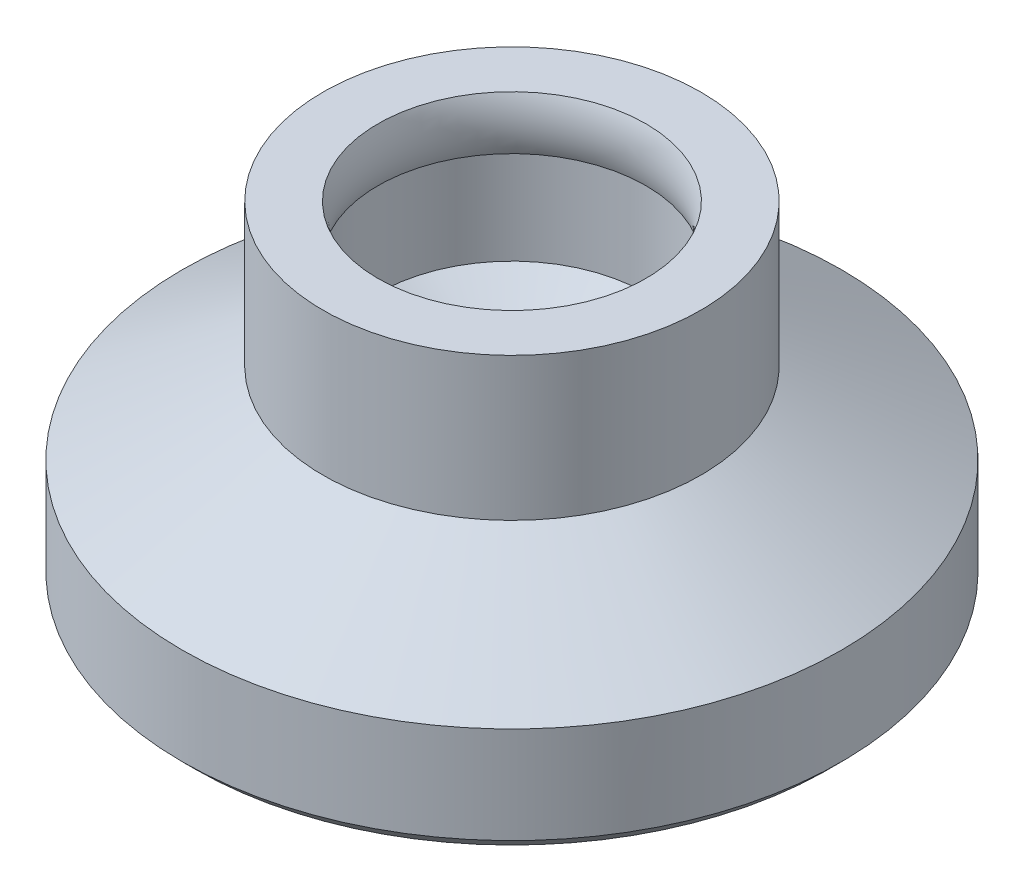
from build123d import *

# Parameters (mm, degrees)
SKETCH1_R      = 4.3
EXTRUDE1_DEPTH = 3.8
SKETCH3_R      = 7.5
EXTRUDE2_DEPTH = 2.5
CHAMFER1_SIZE  = 0.3


with BuildPart() as part:
    # Sketch1 → Extrude1 (new, symmetric)
    with BuildSketch(Plane(origin=(0, 0, 0), x_dir=(1, 0, 0), z_dir=(0, 1, 0))):
        with Locations(Location((0, 0, 0), (0, 0, 90))):
            Circle(SKETCH1_R)
    extrude(amount=EXTRUDE1_DEPTH, both=True)

    # Sketch3 → Extrude2 (add)
    with BuildSketch(Plane.XZ.offset(3.8)):
        with Locations(Location((0, 0, 0), (0, 0, 270))):
            Circle(SKETCH3_R)
    extrude(amount=-EXTRUDE2_DEPTH)

    # Sketch4 → Revolve1 (revolve)
    with BuildSketch(Plane.XY, mode=Mode.PRIVATE) as revolve1_sk:
        Polygon((-7.5, -1.3), (-4.3, 0.547520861), (-4.3, -1.3), align=None)
    revolve(revolve1_sk.sketch.rotate(Axis((0, 3.8, 0), (0, -1, 0)), 90), axis=Axis((0, 3.8, 0), (0, -1, 0)))

    # Chamfer1
    chamfer1_edges = [part.edges().sort_by_distance(p)[0] for p in [
        (0, -3.8, 7.5),
    ]]
    chamfer(chamfer1_edges, length=CHAMFER1_SIZE)

    # Sketch5 → Cut-Revolve1 (revolve, cut)
    with BuildSketch(Plane.XY, mode=Mode.PRIVATE) as cut_revolve1_sk:
        with BuildLine():
            Line((0, 3.8), (3.05, 3.8))
            ThreePointArc((3.05, 3.8), (2.928, 3.19), (3.05, 2.58))
            Line((3.05, 2.58), (3.05, 0.460918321))
            Line((3.05, 0.460918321), (0, -1.3))
            Line((0, -1.3), (0, 3.8))
        make_face()
    revolve(cut_revolve1_sk.sketch.rotate(Axis((0, 0, 0), (0, 1, 0)), 270), axis=Axis((0, 0, 0), (0, 1, 0)), mode=Mode.SUBTRACT)


solid = part.part
